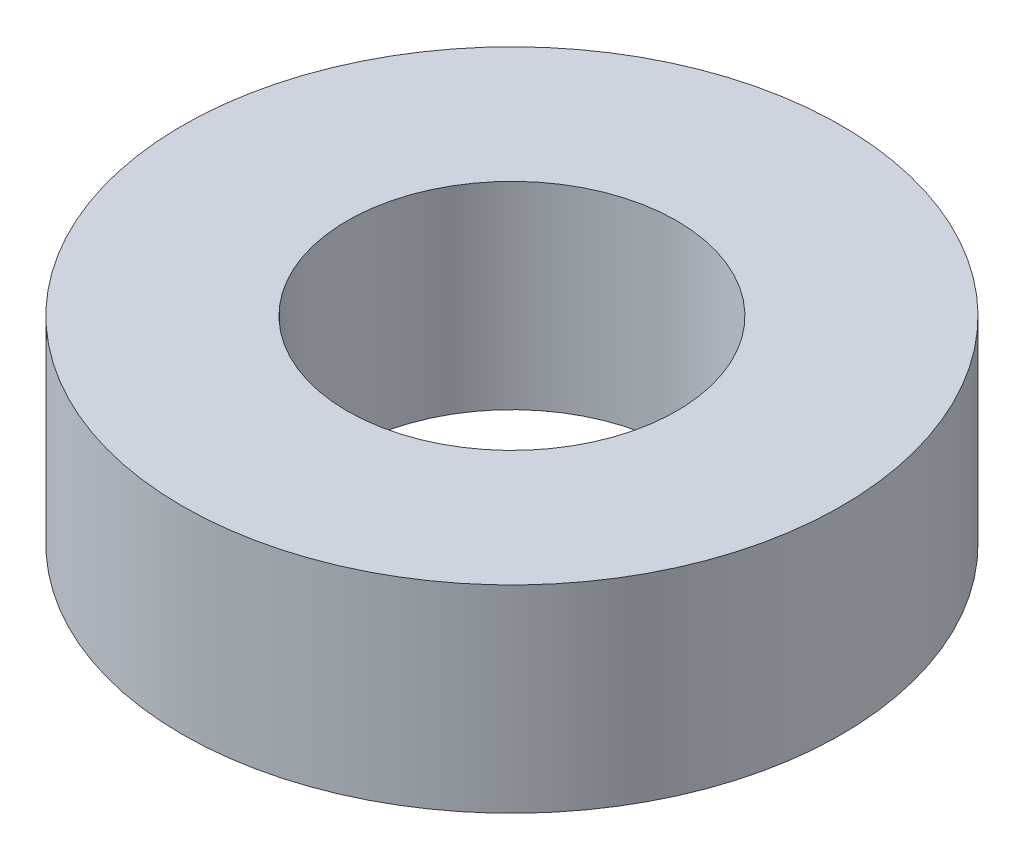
from build123d import *

# Parameters (mm, degrees)
SKETCH1_R           = 50
SKETCH1_R_2         = 25
BOSS_EXTRUDE1_DEPTH = 30


with BuildPart() as part:
    # Sketch1 → Boss-Extrude1 (new body)
    with BuildSketch(Plane(origin=(0, 0, 0), x_dir=(1, 0, 0), z_dir=(0, 1, 0))):
        with Locations(Location((0, 0, 0), (0, 0, 270))):
            Circle(SKETCH1_R)
        with Locations(Location((0, 0, 0), (0, 0, 270))):
            Circle(SKETCH1_R_2, mode=Mode.SUBTRACT)
    extrude(amount=BOSS_EXTRUDE1_DEPTH)


solid = part.part
